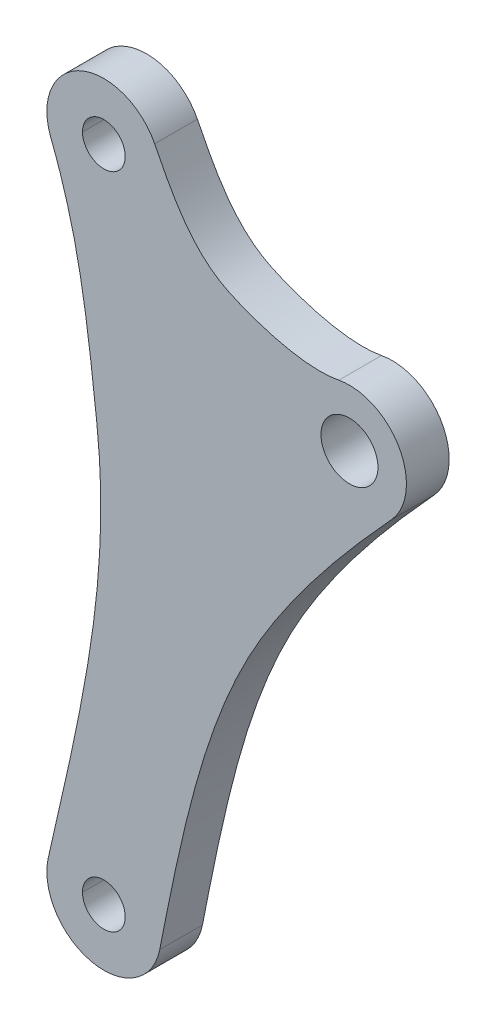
ISO-10303-21;
HEADER;
FILE_DESCRIPTION(('STEP AP214'),'2;1');
FILE_NAME('part.step','',(''),(''),'','','');
FILE_SCHEMA(('AUTOMOTIVE_DESIGN { 1 0 10303 214 1 1 1 1 }'));
ENDSEC;
DATA;
#1=APPLICATION_CONTEXT('core data for automotive mechanical design processes');
#2=APPLICATION_PROTOCOL_DEFINITION('international standard','automotive_design',2000,#1);
#3=PRODUCT_CONTEXT('',#1,'mechanical');
#4=PRODUCT('Part','Part','',(#3));
#5=PRODUCT_RELATED_PRODUCT_CATEGORY('part','',(#4));
#6=PRODUCT_DEFINITION_FORMATION('','',#4);
#7=PRODUCT_DEFINITION_CONTEXT('part definition',#1,'design');
#8=PRODUCT_DEFINITION('design','',#6,#7);
#9=PRODUCT_DEFINITION_SHAPE('','',#8);
#10=(LENGTH_UNIT() NAMED_UNIT(*) SI_UNIT(.MILLI.,.METRE.));
#11=(NAMED_UNIT(*) PLANE_ANGLE_UNIT() SI_UNIT($,.RADIAN.));
#12=(NAMED_UNIT(*) SI_UNIT($,.STERADIAN.) SOLID_ANGLE_UNIT());
#13=UNCERTAINTY_MEASURE_WITH_UNIT(LENGTH_MEASURE(1.E-05),#10,'distance_accuracy_value','');
#14=(GEOMETRIC_REPRESENTATION_CONTEXT(3) GLOBAL_UNCERTAINTY_ASSIGNED_CONTEXT((#13)) GLOBAL_UNIT_ASSIGNED_CONTEXT((#10,
#11,#12)) REPRESENTATION_CONTEXT('',''));
#15=CARTESIAN_POINT('',(0.,0.,0.));
#16=DIRECTION('',(0.,0.,1.));
#17=DIRECTION('',(1.,0.,0.));
#18=AXIS2_PLACEMENT_3D('',#15,#16,#17);
#19=CARTESIAN_POINT('',(81.0474776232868,29.1741521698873,3.));
#20=DIRECTION('',(0.,0.,-1.));
#21=DIRECTION('',(-1.,0.,0.));
#22=AXIS2_PLACEMENT_3D('',#19,#20,#21);
#23=CYLINDRICAL_SURFACE('',#22,4.);
#24=DIRECTION('',(0.,0.,-1.));
#25=VECTOR('',#24,1.);
#26=CARTESIAN_POINT('',(77.145713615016,30.0551956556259,1.5));
#27=LINE('',#26,#25);
#28=CARTESIAN_POINT('',(77.145713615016,30.0551956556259,3.));
#29=VERTEX_POINT('',#28);
#30=CARTESIAN_POINT('',(77.145713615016,30.0551956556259,0.));
#31=VERTEX_POINT('',#30);
#32=EDGE_CURVE('E125',#29,#31,#27,.T.);
#33=ORIENTED_EDGE('',*,*,#32,.T.);
#34=CARTESIAN_POINT('',(81.0474776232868,29.1741521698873,0.));
#35=DIRECTION('',(0.,0.,-1.));
#36=DIRECTION('',(-1.,0.,0.));
#37=AXIS2_PLACEMENT_3D('',#34,#35,#36);
#38=CIRCLE('',#37,4.);
#39=CARTESIAN_POINT('',(77.0474776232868,29.1741521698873,0.));
#40=VERTEX_POINT('',#39);
#41=EDGE_CURVE('E299',#40,#31,#38,.T.);
#42=ORIENTED_EDGE('',*,*,#41,.F.);
#43=DIRECTION('',(0.,0.,-1.));
#44=VECTOR('',#43,1.);
#45=CARTESIAN_POINT('',(77.0474776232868,29.1741521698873,3.));
#46=LINE('',#45,#44);
#47=CARTESIAN_POINT('',(77.0474776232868,29.1741521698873,3.));
#48=VERTEX_POINT('',#47);
#49=EDGE_CURVE('E126',#48,#40,#46,.T.);
#50=ORIENTED_EDGE('',*,*,#49,.F.);
#51=CARTESIAN_POINT('',(81.0474776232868,29.1741521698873,3.));
#52=DIRECTION('',(0.,0.,-1.));
#53=DIRECTION('',(-1.,0.,0.));
#54=AXIS2_PLACEMENT_3D('',#51,#52,#53);
#55=CIRCLE('',#54,4.);
#56=EDGE_CURVE('E37',#48,#29,#55,.T.);
#57=ORIENTED_EDGE('',*,*,#56,.T.);
#58=EDGE_LOOP('',(#33,#42,#50,#57));
#59=FACE_BOUND('',#58,.T.);
#60=ADVANCED_FACE('F30',(#59),#23,.T.);
#61=CARTESIAN_POINT('',(81.0474776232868,75.4068420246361,3.));
#62=DIRECTION('',(0.,0.,-1.));
#63=DIRECTION('',(-1.,0.,0.));
#64=AXIS2_PLACEMENT_3D('',#61,#62,#63);
#65=CYLINDRICAL_SURFACE('',#64,4.);
#66=CARTESIAN_POINT('',(81.0474776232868,75.4068420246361,0.));
#67=DIRECTION('',(0.,0.,-1.));
#68=DIRECTION('',(-1.,0.,0.));
#69=AXIS2_PLACEMENT_3D('',#66,#67,#68);
#70=CIRCLE('',#69,4.);
#71=CARTESIAN_POINT('',(77.3244716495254,73.9442325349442,0.));
#72=VERTEX_POINT('',#71);
#73=CARTESIAN_POINT('',(77.0474776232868,75.4068420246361,0.));
#74=VERTEX_POINT('',#73);
#75=EDGE_CURVE('E274',#72,#74,#70,.T.);
#76=ORIENTED_EDGE('',*,*,#75,.F.);
#77=DIRECTION('',(0.,0.,1.));
#78=VECTOR('',#77,1.);
#79=CARTESIAN_POINT('',(77.3244716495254,73.9442325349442,1.5));
#80=LINE('',#79,#78);
#81=CARTESIAN_POINT('',(77.3244716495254,73.9442325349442,3.));
#82=VERTEX_POINT('',#81);
#83=EDGE_CURVE('E137',#72,#82,#80,.T.);
#84=ORIENTED_EDGE('',*,*,#83,.T.);
#85=CARTESIAN_POINT('',(81.0474776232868,75.4068420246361,3.));
#86=DIRECTION('',(0.,0.,-1.));
#87=DIRECTION('',(-1.,0.,0.));
#88=AXIS2_PLACEMENT_3D('',#85,#86,#87);
#89=CIRCLE('',#88,4.);
#90=CARTESIAN_POINT('',(77.0474776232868,75.4068420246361,3.));
#91=VERTEX_POINT('',#90);
#92=EDGE_CURVE('E128',#82,#91,#89,.T.);
#93=ORIENTED_EDGE('',*,*,#92,.T.);
#94=DIRECTION('',(0.,0.,-1.));
#95=VECTOR('',#94,1.);
#96=CARTESIAN_POINT('',(77.0474776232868,75.4068420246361,3.));
#97=LINE('',#96,#95);
#98=EDGE_CURVE('E269',#74,#91,#97,.F.);
#99=ORIENTED_EDGE('',*,*,#98,.F.);
#100=EDGE_LOOP('',(#76,#84,#93,#99));
#101=FACE_BOUND('',#100,.T.);
#102=ADVANCED_FACE('F222',(#101),#65,.T.);
#103=CARTESIAN_POINT('',(90.075671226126,46.9690028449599,0.));
#104=DIRECTION('',(0.,0.,-1.));
#105=DIRECTION('',(-1.,0.,0.));
#106=AXIS2_PLACEMENT_3D('',#103,#104,#105);
#107=PLANE('',#106);
#108=CARTESIAN_POINT('',(98.2930047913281,65.3775283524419,0.));
#109=DIRECTION('',(0.,0.,1.));
#110=DIRECTION('',(1.,0.,0.));
#111=AXIS2_PLACEMENT_3D('',#108,#109,#110);
#112=CIRCLE('',#111,2.);
#113=CARTESIAN_POINT('',(100.293004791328,65.3775283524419,0.));
#114=VERTEX_POINT('',#113);
#115=EDGE_CURVE('E129',#114,#114,#112,.T.);
#116=ORIENTED_EDGE('',*,*,#115,.T.);
#117=EDGE_LOOP('',(#116));
#118=FACE_BOUND('',#117,.T.);
#119=CARTESIAN_POINT('',(81.0474776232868,29.1741521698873,0.));
#120=DIRECTION('',(0.,0.,-1.));
#121=DIRECTION('',(-1.,0.,0.));
#122=AXIS2_PLACEMENT_3D('',#119,#120,#121);
#123=CIRCLE('',#122,1.5);
#124=CARTESIAN_POINT('',(79.5474776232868,29.1741521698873,0.));
#125=VERTEX_POINT('',#124);
#126=CARTESIAN_POINT('',(82.5474776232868,29.1741521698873,0.));
#127=VERTEX_POINT('',#126);
#128=EDGE_CURVE('E246',#125,#127,#123,.F.);
#129=ORIENTED_EDGE('',*,*,#128,.T.);
#130=CARTESIAN_POINT('',(81.0474776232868,29.1741521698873,0.));
#131=DIRECTION('',(0.,0.,-1.));
#132=DIRECTION('',(-1.,0.,0.));
#133=AXIS2_PLACEMENT_3D('',#130,#131,#132);
#134=CIRCLE('',#133,1.5);
#135=EDGE_CURVE('E245',#127,#125,#134,.F.);
#136=ORIENTED_EDGE('',*,*,#135,.T.);
#137=EDGE_LOOP('',(#129,#136));
#138=FACE_BOUND('',#137,.T.);
#139=CARTESIAN_POINT('',(81.0474776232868,75.4068420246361,0.));
#140=DIRECTION('',(0.,0.,-1.));
#141=DIRECTION('',(-1.,0.,0.));
#142=AXIS2_PLACEMENT_3D('',#139,#140,#141);
#143=CIRCLE('',#142,1.5);
#144=CARTESIAN_POINT('',(79.5474776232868,75.4068420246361,0.));
#145=VERTEX_POINT('',#144);
#146=CARTESIAN_POINT('',(82.5474776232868,75.4068420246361,0.));
#147=VERTEX_POINT('',#146);
#148=EDGE_CURVE('E241',#145,#147,#143,.F.);
#149=ORIENTED_EDGE('',*,*,#148,.T.);
#150=CARTESIAN_POINT('',(81.0474776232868,75.4068420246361,0.));
#151=DIRECTION('',(0.,0.,-1.));
#152=DIRECTION('',(-1.,0.,0.));
#153=AXIS2_PLACEMENT_3D('',#150,#151,#152);
#154=CIRCLE('',#153,1.5);
#155=EDGE_CURVE('E237',#147,#145,#154,.F.);
#156=ORIENTED_EDGE('',*,*,#155,.T.);
#157=EDGE_LOOP('',(#149,#156));
#158=FACE_BOUND('',#157,.T.);
#159=CARTESIAN_POINT('',(84.6155667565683,77.2148077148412,0.));
#160=CARTESIAN_POINT('',(84.6916915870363,77.0645560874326,0.));
#161=CARTESIAN_POINT('',(84.7677576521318,76.9142716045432,0.));
#162=CARTESIAN_POINT('',(84.9211593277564,76.6126359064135,0.));
#163=CARTESIAN_POINT('',(84.9985001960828,76.4612873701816,0.));
#164=CARTESIAN_POINT('',(85.1549995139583,76.1582612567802,0.));
#165=CARTESIAN_POINT('',(85.2341665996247,76.0065881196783,0.));
#166=CARTESIAN_POINT('',(85.3948587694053,75.7036492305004,0.));
#167=CARTESIAN_POINT('',(85.4763925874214,75.5523880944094,0.));
#168=CARTESIAN_POINT('',(85.6423667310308,75.2510130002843,0.));
#169=CARTESIAN_POINT('',(85.7268132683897,75.1009024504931,0.));
#170=CARTESIAN_POINT('',(85.8991679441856,74.8025714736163,0.));
#171=CARTESIAN_POINT('',(85.9870778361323,74.6543520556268,0.));
#172=CARTESIAN_POINT('',(86.1640529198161,74.3652413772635,0.));
#173=CARTESIAN_POINT('',(86.2529855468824,74.224269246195,0.));
#174=CARTESIAN_POINT('',(86.435151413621,73.9454726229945,0.));
#175=CARTESIAN_POINT('',(86.5283768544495,73.8076430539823,0.));
#176=CARTESIAN_POINT('',(86.7196648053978,73.5358203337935,0.));
#177=CARTESIAN_POINT('',(86.8177162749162,73.4018194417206,0.));
#178=CARTESIAN_POINT('',(87.019206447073,73.1383528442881,0.));
#179=CARTESIAN_POINT('',(87.1226335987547,73.0088783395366,0.));
#180=CARTESIAN_POINT('',(87.3354385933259,72.7551765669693,0.));
#181=CARTESIAN_POINT('',(87.4448087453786,72.6309428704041,0.));
#182=CARTESIAN_POINT('',(87.6700871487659,72.3884426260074,0.));
#183=CARTESIAN_POINT('',(87.7859976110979,72.2701781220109,0.));
#184=CARTESIAN_POINT('',(88.0016890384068,72.0627317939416,0.));
#185=CARTESIAN_POINT('',(88.1002932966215,71.9723261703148,0.));
#186=CARTESIAN_POINT('',(88.3020590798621,71.7966208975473,0.));
#187=CARTESIAN_POINT('',(88.4052230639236,71.7113240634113,0.));
#188=CARTESIAN_POINT('',(88.6159711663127,71.5465057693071,0.));
#189=CARTESIAN_POINT('',(88.7235526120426,71.4669808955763,0.));
#190=CARTESIAN_POINT('',(88.9429316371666,71.3142609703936,0.));
#191=CARTESIAN_POINT('',(89.0547236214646,71.2410579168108,0.));
#192=CARTESIAN_POINT('',(89.2256457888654,71.1362219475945,0.));
#193=CARTESIAN_POINT('',(89.2832387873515,71.1020620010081,0.));
#194=CARTESIAN_POINT('',(89.3993813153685,71.0354074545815,0.));
#195=CARTESIAN_POINT('',(89.4579308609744,71.0029128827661,0.));
#196=CARTESIAN_POINT('',(89.634859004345,70.9076505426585,0.));
#197=CARTESIAN_POINT('',(89.7544559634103,70.8471412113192,0.));
#198=CARTESIAN_POINT('',(89.9961430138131,70.7309904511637,0.));
#199=CARTESIAN_POINT('',(90.1182359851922,70.6753550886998,0.));
#200=CARTESIAN_POINT('',(90.36417688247,70.5679245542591,0.));
#201=CARTESIAN_POINT('',(90.4880258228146,70.5161317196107,0.));
#202=CARTESIAN_POINT('',(90.6942065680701,70.432656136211,0.));
#203=CARTESIAN_POINT('',(90.7762151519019,70.4001664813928,0.));
#204=CARTESIAN_POINT('',(90.9406019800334,70.336133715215,0.));
#205=CARTESIAN_POINT('',(91.0229802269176,70.3045906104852,0.));
#206=CARTESIAN_POINT('',(91.1880365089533,70.2425131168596,0.));
#207=CARTESIAN_POINT('',(91.2707142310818,70.2119778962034,0.));
#208=CARTESIAN_POINT('',(91.4364334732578,70.1519146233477,0.));
#209=CARTESIAN_POINT('',(91.5194749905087,70.1223865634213,0.));
#210=CARTESIAN_POINT('',(91.7690685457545,70.0353854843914,0.));
#211=CARTESIAN_POINT('',(91.9361661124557,69.9794667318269,0.));
#212=CARTESIAN_POINT('',(92.2717891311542,69.8720649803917,0.));
#213=CARTESIAN_POINT('',(92.4403146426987,69.8205821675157,0.));
#214=CARTESIAN_POINT('',(92.7785680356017,69.7224625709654,0.));
#215=CARTESIAN_POINT('',(92.9482943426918,69.6758203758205,0.));
#216=CARTESIAN_POINT('',(93.2891243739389,69.5877349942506,0.));
#217=CARTESIAN_POINT('',(93.460228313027,69.5462926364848,0.));
#218=CARTESIAN_POINT('',(93.8037340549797,69.4691331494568,0.));
#219=CARTESIAN_POINT('',(93.9761359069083,69.4334162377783,0.));
#220=CARTESIAN_POINT('',(94.3221883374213,69.3683329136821,0.));
#221=CARTESIAN_POINT('',(94.4958391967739,69.3389679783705,0.));
#222=CARTESIAN_POINT('',(94.7891131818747,69.2955385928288,0.));
#223=CARTESIAN_POINT('',(94.9084560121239,69.2795722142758,0.));
#224=CARTESIAN_POINT('',(95.147556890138,69.2512787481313,0.));
#225=CARTESIAN_POINT('',(95.2673148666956,69.238951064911,0.));
#226=CARTESIAN_POINT('',(95.5071056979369,69.2182783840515,0.));
#227=CARTESIAN_POINT('',(95.6271383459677,69.2099310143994,0.));
#228=CARTESIAN_POINT('',(95.8673441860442,69.1976060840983,0.));
#229=CARTESIAN_POINT('',(95.9875172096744,69.1936253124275,0.));
#230=CARTESIAN_POINT('',(96.2279725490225,69.1904747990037,0.));
#231=CARTESIAN_POINT('',(96.348254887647,69.1913066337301,0.));
#232=CARTESIAN_POINT('',(96.5887064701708,69.1983090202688,0.));
#233=CARTESIAN_POINT('',(96.7088756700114,69.204481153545,0.));
#234=CARTESIAN_POINT('',(96.9489637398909,69.2227735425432,0.));
#235=CARTESIAN_POINT('',(97.0688819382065,69.2349029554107,0.));
#236=CARTESIAN_POINT('',(97.308286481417,69.2658634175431,0.));
#237=CARTESIAN_POINT('',(97.4277696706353,69.2847186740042,0.));
#238=CARTESIAN_POINT('',(97.5465993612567,69.3072712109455,0.));
#239=B_SPLINE_CURVE_WITH_KNOTS('',3,(#159,#160,#161,#162,#163,#164,#165,#166,#167,#168,#169,
#170,#171,#172,#173,#174,#175,#176,#177,#178,#179,#180,#181,#182,#183,#184,#185,#186,#187,#188,
#189,#190,#191,#192,#193,#194,#195,#196,#197,#198,#199,#200,#201,#202,#203,#204,#205,#206,#207,
#208,#209,#210,#211,#212,#213,#214,#215,#216,#217,#218,#219,#220,#221,#222,#223,#224,#225,#226,
#227,#228,#229,#230,#231,#232,#233,#234,#235,#236,#237,#238),.UNSPECIFIED.,.F.,.F.,(4,2,2,2,2,2,
2,2,2,2,2,2,2,2,2,2,2,2,2,2,2,2,2,2,2,2,2,2,2,2,2,2,2,2,2,2,2,2,2,4),(0.,0.505311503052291,
1.01520348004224,1.52846654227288,2.04395450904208,2.56061957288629,3.07754967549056,
3.57751746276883,4.07661026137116,4.57461001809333,5.07158069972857,5.56792289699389,
6.06443390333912,6.46560347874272,6.86699210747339,7.26814137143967,7.668775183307,
7.8696349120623,8.0704980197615,8.47243845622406,8.87487226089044,9.2775488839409,
9.54217331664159,9.80679960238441,10.0712017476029,10.3356018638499,10.8641568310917,
11.3927339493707,11.9207136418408,12.4487773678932,12.976861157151,13.5050676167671,
13.8662378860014,14.2273490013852,14.5882446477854,14.9488747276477,15.3096229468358,
15.6704780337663,16.0318895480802,16.3946151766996),.UNSPECIFIED.);
#240=CARTESIAN_POINT('',(84.6155667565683,77.2148077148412,0.));
#241=VERTEX_POINT('',#240);
#242=CARTESIAN_POINT('',(97.5465993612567,69.3072712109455,0.));
#243=VERTEX_POINT('',#242);
#244=EDGE_CURVE('E203',#241,#243,#239,.T.);
#245=ORIENTED_EDGE('',*,*,#244,.T.);
#246=CARTESIAN_POINT('',(98.2930047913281,65.3775283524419,0.));
#247=DIRECTION('',(0.,0.,-1.));
#248=DIRECTION('',(-1.,0.,0.));
#249=AXIS2_PLACEMENT_3D('',#246,#247,#248);
#250=CIRCLE('',#249,4.);
#251=CARTESIAN_POINT('',(101.238857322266,62.6716176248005,0.));
#252=VERTEX_POINT('',#251);
#253=EDGE_CURVE('E211',#252,#243,#250,.F.);
#254=ORIENTED_EDGE('',*,*,#253,.F.);
#255=CARTESIAN_POINT('',(101.238857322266,62.6716176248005,0.));
#256=CARTESIAN_POINT('',(101.069756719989,62.4875216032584,0.));
#257=CARTESIAN_POINT('',(100.901121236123,62.3029974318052,0.));
#258=CARTESIAN_POINT('',(100.564933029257,61.9330921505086,0.));
#259=CARTESIAN_POINT('',(100.397379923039,61.7477113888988,0.));
#260=CARTESIAN_POINT('',(100.063425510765,61.3760027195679,0.));
#261=CARTESIAN_POINT('',(99.8970239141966,61.1896750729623,0.));
#262=CARTESIAN_POINT('',(99.5654448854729,60.8159801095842,0.));
#263=CARTESIAN_POINT('',(99.4002672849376,60.6286129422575,0.));
#264=CARTESIAN_POINT('',(99.0708807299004,60.2523668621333,0.));
#265=CARTESIAN_POINT('',(98.9066743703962,60.0634856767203,0.));
#266=CARTESIAN_POINT('',(98.5796450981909,59.6844877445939,0.));
#267=CARTESIAN_POINT('',(98.4168223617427,59.4943708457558,0.));
#268=CARTESIAN_POINT('',(98.0926424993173,59.1128022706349,0.));
#269=CARTESIAN_POINT('',(97.9312857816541,58.9213502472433,0.));
#270=CARTESIAN_POINT('',(97.6101244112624,58.5370104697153,0.));
#271=CARTESIAN_POINT('',(97.4503204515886,58.3441221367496,0.));
#272=CARTESIAN_POINT('',(96.9855066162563,57.7779311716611,0.));
#273=CARTESIAN_POINT('',(96.6828395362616,57.4026986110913,0.));
#274=CARTESIAN_POINT('',(96.0846754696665,56.6463226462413,0.));
#275=CARTESIAN_POINT('',(95.789181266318,56.2651770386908,0.));
#276=CARTESIAN_POINT('',(95.2064262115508,55.4966808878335,0.));
#277=CARTESIAN_POINT('',(94.9191647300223,55.1093308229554,0.));
#278=CARTESIAN_POINT('',(94.3539533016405,54.3281136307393,0.));
#279=CARTESIAN_POINT('',(94.0759996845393,53.9342491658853,0.));
#280=CARTESIAN_POINT('',(93.6668141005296,53.3383054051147,0.));
#281=CARTESIAN_POINT('',(93.5317451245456,53.1388541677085,0.));
#282=CARTESIAN_POINT('',(93.2643323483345,52.7381337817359,0.));
#283=CARTESIAN_POINT('',(93.1319885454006,52.5368646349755,0.));
#284=CARTESIAN_POINT('',(92.7395857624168,51.9303123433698,0.));
#285=CARTESIAN_POINT('',(92.4840264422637,51.5220974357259,0.));
#286=CARTESIAN_POINT('',(91.9868915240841,50.6963452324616,0.));
#287=CARTESIAN_POINT('',(91.7453381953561,50.2787944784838,0.));
#288=CARTESIAN_POINT('',(91.2790742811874,49.4343088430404,0.));
#289=CARTESIAN_POINT('',(91.054365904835,49.0073727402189,0.));
#290=CARTESIAN_POINT('',(90.6212412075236,48.1451837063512,0.));
#291=CARTESIAN_POINT('',(90.412829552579,47.7099284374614,0.));
#292=CARTESIAN_POINT('',(90.0116275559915,46.8321253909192,0.));
#293=CARTESIAN_POINT('',(89.8188421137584,46.3895753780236,0.));
#294=CARTESIAN_POINT('',(89.4480534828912,45.4982966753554,0.));
#295=CARTESIAN_POINT('',(89.2700515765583,45.049567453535,0.));
#296=CARTESIAN_POINT('',(88.9278721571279,44.1470919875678,0.));
#297=CARTESIAN_POINT('',(88.7636890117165,43.6933478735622,0.));
#298=CARTESIAN_POINT('',(88.4668681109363,42.8362709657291,0.));
#299=CARTESIAN_POINT('',(88.3328098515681,42.4334279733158,0.));
#300=CARTESIAN_POINT('',(88.073635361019,41.6250208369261,0.));
#301=CARTESIAN_POINT('',(87.9485163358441,41.2194575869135,0.));
#302=CARTESIAN_POINT('',(87.70630914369,40.4059441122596,0.));
#303=CARTESIAN_POINT('',(87.5892210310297,39.9979938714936,0.));
#304=CARTESIAN_POINT('',(87.3621782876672,39.1800337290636,0.));
#305=CARTESIAN_POINT('',(87.2522250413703,38.7700234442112,0.));
#306=CARTESIAN_POINT('',(87.0385735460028,37.9482658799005,0.));
#307=CARTESIAN_POINT('',(86.9348769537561,37.5365181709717,0.));
#308=CARTESIAN_POINT('',(86.7328822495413,36.71160209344,0.));
#309=CARTESIAN_POINT('',(86.6345854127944,36.298433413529,0.));
#310=CARTESIAN_POINT('',(86.442393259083,35.4702714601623,0.));
#311=CARTESIAN_POINT('',(86.3485064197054,35.0552762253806,0.));
#312=CARTESIAN_POINT('',(86.1645092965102,34.2244802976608,0.));
#313=CARTESIAN_POINT('',(86.0743987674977,33.8086796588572,0.));
#314=CARTESIAN_POINT('',(85.8971796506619,32.9765816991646,0.));
#315=CARTESIAN_POINT('',(85.8100701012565,32.5602845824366,0.));
#316=CARTESIAN_POINT('',(85.6381116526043,31.7274955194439,0.));
#317=CARTESIAN_POINT('',(85.5532613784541,31.3110038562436,0.));
#318=CARTESIAN_POINT('',(85.3851124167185,30.4781211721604,0.));
#319=CARTESIAN_POINT('',(85.3018123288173,30.0617304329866,0.));
#320=CARTESIAN_POINT('',(85.1360997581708,29.229334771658,0.));
#321=CARTESIAN_POINT('',(85.0536862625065,28.8133300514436,0.));
#322=CARTESIAN_POINT('',(84.9713185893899,28.397317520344,0.));
#323=B_SPLINE_CURVE_WITH_KNOTS('',3,(#255,#256,#257,#258,#259,#260,#261,#262,#263,#264,#265,
#266,#267,#268,#269,#270,#271,#272,#273,#274,#275,#276,#277,#278,#279,#280,#281,#282,#283,#284,
#285,#286,#287,#288,#289,#290,#291,#292,#293,#294,#295,#296,#297,#298,#299,#300,#301,#302,#303,
#304,#305,#306,#307,#308,#309,#310,#311,#312,#313,#314,#315,#316,#317,#318,#319,#320,#321,#322),
.UNSPECIFIED.,.F.,.F.,(4,2,2,2,2,2,2,2,2,2,2,2,2,2,2,2,2,2,2,2,2,2,2,2,2,2,2,2,2,2,2,2,2,4),(0.,
0.749918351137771,1.49955478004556,2.2489946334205,2.99832940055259,3.74916145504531,
4.50008776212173,5.25121717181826,6.00266771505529,7.44884018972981,8.89556512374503,
10.3421790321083,11.788215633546,12.5108439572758,13.2334715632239,14.6780457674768,
16.1248571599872,17.5718579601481,19.0192715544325,20.4671372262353,21.9151283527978,
23.36252641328,24.6361070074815,25.9092877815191,27.1824771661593,28.4559128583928,
29.7296843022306,31.0037552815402,32.2801828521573,33.5565274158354,34.8324591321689,
36.1075957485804,37.3815183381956,38.6537851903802),.UNSPECIFIED.);
#324=CARTESIAN_POINT('',(84.9713185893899,28.397317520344,0.));
#325=VERTEX_POINT('',#324);
#326=EDGE_CURVE('E231',#252,#325,#323,.T.);
#327=ORIENTED_EDGE('',*,*,#326,.T.);
#328=CARTESIAN_POINT('',(81.0474776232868,29.1741521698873,0.));
#329=DIRECTION('',(0.,0.,-1.));
#330=DIRECTION('',(-1.,0.,0.));
#331=AXIS2_PLACEMENT_3D('',#328,#329,#330);
#332=CIRCLE('',#331,4.);
#333=EDGE_CURVE('E272',#40,#325,#332,.F.);
#334=ORIENTED_EDGE('',*,*,#333,.F.);
#335=ORIENTED_EDGE('',*,*,#41,.T.);
#336=CARTESIAN_POINT('',(77.145713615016,30.0551956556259,0.));
#337=CARTESIAN_POINT('',(77.2190664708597,30.3800420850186,0.));
#338=CARTESIAN_POINT('',(77.292754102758,30.7048124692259,0.));
#339=CARTESIAN_POINT('',(77.4404934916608,31.3542740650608,0.));
#340=CARTESIAN_POINT('',(77.5145452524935,31.678965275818,0.));
#341=CARTESIAN_POINT('',(77.662706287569,32.3283362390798,0.));
#342=CARTESIAN_POINT('',(77.7368155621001,32.6530159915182,0.));
#343=CARTESIAN_POINT('',(77.8849229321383,33.3030275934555,0.));
#344=CARTESIAN_POINT('',(77.958920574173,33.6283595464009,0.));
#345=CARTESIAN_POINT('',(78.1063623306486,34.2791475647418,0.));
#346=CARTESIAN_POINT('',(78.1798064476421,34.6046036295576,0.));
#347=CARTESIAN_POINT('',(78.3258351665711,35.2557072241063,0.));
#348=CARTESIAN_POINT('',(78.3984197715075,35.5813547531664,0.));
#349=CARTESIAN_POINT('',(78.6145934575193,36.5594489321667,0.));
#350=CARTESIAN_POINT('',(78.756428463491,37.2122860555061,0.));
#351=CARTESIAN_POINT('',(79.0329288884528,38.5194953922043,0.));
#352=CARTESIAN_POINT('',(79.1675942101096,39.1738676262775,0.));
#353=CARTESIAN_POINT('',(79.4272070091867,40.484638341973,0.));
#354=CARTESIAN_POINT('',(79.5521532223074,41.1410370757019,0.));
#355=CARTESIAN_POINT('',(79.7895151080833,42.4553037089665,0.));
#356=CARTESIAN_POINT('',(79.901945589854,43.1131689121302,0.));
#357=CARTESIAN_POINT('',(80.1116984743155,44.4312853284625,0.));
#358=CARTESIAN_POINT('',(80.209021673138,45.0915364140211,0.));
#359=CARTESIAN_POINT('',(80.3857091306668,46.4143817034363,0.));
#360=CARTESIAN_POINT('',(80.4650759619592,47.076975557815,0.));
#361=CARTESIAN_POINT('',(80.5689827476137,48.0774882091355,0.));
#362=CARTESIAN_POINT('',(80.6012752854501,48.4146109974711,0.));
#363=CARTESIAN_POINT('',(80.6600912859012,49.0893708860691,0.));
#364=CARTESIAN_POINT('',(80.6866146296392,49.4270079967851,0.));
#365=CARTESIAN_POINT('',(80.7334995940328,50.1027199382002,0.));
#366=CARTESIAN_POINT('',(80.7538610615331,50.4407947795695,0.));
#367=CARTESIAN_POINT('',(80.7880321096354,51.1173295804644,0.));
#368=CARTESIAN_POINT('',(80.8018406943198,51.4557895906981,0.));
#369=CARTESIAN_POINT('',(80.8225120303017,52.1329210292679,0.));
#370=CARTESIAN_POINT('',(80.8293748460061,52.4715924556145,0.));
#371=CARTESIAN_POINT('',(80.8357726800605,53.148998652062,0.));
#372=CARTESIAN_POINT('',(80.8353078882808,53.4877334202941,0.));
#373=CARTESIAN_POINT('',(80.8266735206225,54.1653391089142,0.));
#374=CARTESIAN_POINT('',(80.8184986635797,54.50420996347,0.));
#375=CARTESIAN_POINT('',(80.7940861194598,55.1816652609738,0.));
#376=CARTESIAN_POINT('',(80.7778484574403,55.5202497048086,0.));
#377=CARTESIAN_POINT('',(80.73694277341,56.196886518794,0.));
#378=CARTESIAN_POINT('',(80.7122751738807,56.5349389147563,0.));
#379=CARTESIAN_POINT('',(80.6562590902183,57.2104406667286,0.));
#380=CARTESIAN_POINT('',(80.6249112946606,57.5478900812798,0.));
#381=CARTESIAN_POINT('',(80.557254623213,58.222302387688,0.));
#382=CARTESIAN_POINT('',(80.5209454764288,58.5592652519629,0.));
#383=CARTESIAN_POINT('',(80.4640318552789,59.064438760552,0.));
#384=CARTESIAN_POINT('',(80.444651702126,59.2327899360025,0.));
#385=CARTESIAN_POINT('',(80.4052861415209,59.5694217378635,0.));
#386=CARTESIAN_POINT('',(80.3853007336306,59.737702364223,0.));
#387=CARTESIAN_POINT('',(80.344942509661,60.0743127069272,0.));
#388=CARTESIAN_POINT('',(80.324569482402,60.2426423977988,0.));
#389=CARTESIAN_POINT('',(80.2836232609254,60.5792773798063,0.));
#390=CARTESIAN_POINT('',(80.2630500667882,60.7475826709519,0.));
#391=CARTESIAN_POINT('',(80.2215732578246,61.0841437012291,0.));
#392=CARTESIAN_POINT('',(80.2006696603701,61.2523994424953,0.));
#393=CARTESIAN_POINT('',(80.1584298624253,61.5888565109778,0.));
#394=CARTESIAN_POINT('',(80.1370936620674,61.7570578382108,0.));
#395=CARTESIAN_POINT('',(80.0722678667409,62.2615629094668,0.));
#396=CARTESIAN_POINT('',(80.0279616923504,62.5977627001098,0.));
#397=CARTESIAN_POINT('',(79.9362754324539,63.269717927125,0.));
#398=CARTESIAN_POINT('',(79.888895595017,63.6054733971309,0.));
#399=CARTESIAN_POINT('',(79.7901477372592,64.2763961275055,0.));
#400=CARTESIAN_POINT('',(79.7387797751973,64.6115633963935,0.));
#401=CARTESIAN_POINT('',(79.631161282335,65.2810981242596,0.));
#402=CARTESIAN_POINT('',(79.5749110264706,65.6154656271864,0.));
#403=CARTESIAN_POINT('',(79.4553127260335,66.2908381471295,0.));
#404=CARTESIAN_POINT('',(79.3918315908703,66.6318197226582,0.));
#405=CARTESIAN_POINT('',(79.2580467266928,67.3122641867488,0.));
#406=CARTESIAN_POINT('',(79.1877465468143,67.6517277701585,0.));
#407=CARTESIAN_POINT('',(79.0395856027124,68.328828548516,0.));
#408=CARTESIAN_POINT('',(78.9617286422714,68.6664665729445,0.));
#409=CARTESIAN_POINT('',(78.7978293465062,69.339632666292,0.));
#410=CARTESIAN_POINT('',(78.7117898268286,69.6751614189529,0.));
#411=CARTESIAN_POINT('',(78.5313966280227,70.3424828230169,0.));
#412=CARTESIAN_POINT('',(78.4370790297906,70.6742852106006,0.));
#413=CARTESIAN_POINT('',(78.2394515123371,71.335384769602,0.));
#414=CARTESIAN_POINT('',(78.1361371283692,71.6646806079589,0.));
#415=CARTESIAN_POINT('',(77.9202427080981,72.3206603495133,0.));
#416=CARTESIAN_POINT('',(77.8076517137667,72.6473406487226,0.));
#417=CARTESIAN_POINT('',(77.5730772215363,73.2980309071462,0.));
#418=CARTESIAN_POINT('',(77.4510758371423,73.6220344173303,0.));
#419=CARTESIAN_POINT('',(77.3244716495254,73.9442325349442,0.));
#420=B_SPLINE_CURVE_WITH_KNOTS('',3,(#336,#337,#338,#339,#340,#341,#342,#343,#344,#345,#346,
#347,#348,#349,#350,#351,#352,#353,#354,#355,#356,#357,#358,#359,#360,#361,#362,#363,#364,#365,
#366,#367,#368,#369,#370,#371,#372,#373,#374,#375,#376,#377,#378,#379,#380,#381,#382,#383,#384,
#385,#386,#387,#388,#389,#390,#391,#392,#393,#394,#395,#396,#397,#398,#399,#400,#401,#402,#403,
#404,#405,#406,#407,#408,#409,#410,#411,#412,#413,#414,#415,#416,#417,#418,#419),.UNSPECIFIED.,
.F.,.F.,(4,2,2,2,2,2,2,2,2,2,2,2,2,2,2,2,2,2,2,2,2,2,2,2,2,2,2,2,2,2,2,2,2,2,2,2,2,2,2,2,2,4),
(0.,0.999075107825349,1.99816074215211,2.99725141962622,3.99817520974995,4.99909438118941,
6.00001005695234,8.00418359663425,10.0083843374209,12.0128453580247,14.0149088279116,
16.016866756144,18.0185376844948,19.0344943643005,20.0504719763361,21.0664748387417,
22.0826320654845,23.0987798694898,24.1149013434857,25.1317193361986,26.1485341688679,
27.1652980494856,28.1819571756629,29.19867183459,29.7070602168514,30.2154489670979,
30.7241231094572,31.2327970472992,31.7414443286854,32.2500914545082,33.2674009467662,
34.2846284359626,35.301841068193,36.3189964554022,37.3594558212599,38.3993765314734,
39.4387764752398,40.4778200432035,41.5125406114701,42.5477776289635,43.5842555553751,
44.6227545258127),.UNSPECIFIED.);
#421=EDGE_CURVE('E136',#31,#72,#420,.T.);
#422=ORIENTED_EDGE('',*,*,#421,.T.);
#423=ORIENTED_EDGE('',*,*,#75,.T.);
#424=CARTESIAN_POINT('',(81.0474776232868,75.4068420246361,0.));
#425=DIRECTION('',(0.,0.,-1.));
#426=DIRECTION('',(-1.,0.,0.));
#427=AXIS2_PLACEMENT_3D('',#424,#425,#426);
#428=CIRCLE('',#427,4.);
#429=EDGE_CURVE('E214',#241,#74,#428,.F.);
#430=ORIENTED_EDGE('',*,*,#429,.F.);
#431=EDGE_LOOP('',(#245,#254,#327,#334,#335,#422,#423,#430));
#432=FACE_BOUND('',#431,.T.);
#433=ADVANCED_FACE('F216',(#118,#138,#158,#432),#107,.T.);
#434=CARTESIAN_POINT('',(81.0474776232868,29.1741521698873,3.));
#435=DIRECTION('',(0.,0.,-1.));
#436=DIRECTION('',(-1.,0.,0.));
#437=AXIS2_PLACEMENT_3D('',#434,#435,#436);
#438=CYLINDRICAL_SURFACE('',#437,4.);
#439=ORIENTED_EDGE('',*,*,#333,.T.);
#440=DIRECTION('',(0.,0.,1.));
#441=VECTOR('',#440,1.);
#442=CARTESIAN_POINT('',(84.9713185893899,28.397317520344,1.5));
#443=LINE('',#442,#441);
#444=CARTESIAN_POINT('',(84.9713185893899,28.397317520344,3.));
#445=VERTEX_POINT('',#444);
#446=EDGE_CURVE('E260',#325,#445,#443,.T.);
#447=ORIENTED_EDGE('',*,*,#446,.T.);
#448=CARTESIAN_POINT('',(81.0474776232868,29.1741521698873,3.));
#449=DIRECTION('',(0.,0.,-1.));
#450=DIRECTION('',(-1.,0.,0.));
#451=AXIS2_PLACEMENT_3D('',#448,#449,#450);
#452=CIRCLE('',#451,4.);
#453=EDGE_CURVE('E144',#445,#48,#452,.T.);
#454=ORIENTED_EDGE('',*,*,#453,.T.);
#455=ORIENTED_EDGE('',*,*,#49,.T.);
#456=EDGE_LOOP('',(#439,#447,#454,#455));
#457=FACE_BOUND('',#456,.T.);
#458=ADVANCED_FACE('F221',(#457),#438,.T.);
#459=CARTESIAN_POINT('',(77.3244716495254,73.9442325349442,3.));
#460=CARTESIAN_POINT('',(77.3244716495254,73.9442325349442,0.));
#461=CARTESIAN_POINT('',(79.1435622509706,69.3138200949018,3.));
#462=CARTESIAN_POINT('',(79.1435622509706,69.3138200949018,0.));
#463=CARTESIAN_POINT('',(79.9310185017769,63.6887264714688,3.));
#464=CARTESIAN_POINT('',(79.9310185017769,63.6887264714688,0.));
#465=CARTESIAN_POINT('',(81.6632709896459,48.786134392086,3.));
#466=CARTESIAN_POINT('',(81.6632709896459,48.786134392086,0.));
#467=CARTESIAN_POINT('',(79.0803085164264,38.6226873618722,3.));
#468=CARTESIAN_POINT('',(79.0803085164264,38.6226873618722,0.));
#469=CARTESIAN_POINT('',(77.145713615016,30.0551956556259,3.));
#470=CARTESIAN_POINT('',(77.145713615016,30.0551956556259,0.));
#471=B_SPLINE_SURFACE_WITH_KNOTS('',3,1,((#459,#460),(#461,#462),(#463,#464),(#465,#466),(#467,
#468),(#469,#470)),.UNSPECIFIED.,.F.,.F.,.F.,(4,1,1,4),(2,2),(0.,0.323426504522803,
0.423426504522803,1.),(0.,1.),.UNSPECIFIED.);
#472=CARTESIAN_POINT('',(77.145713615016,30.0551956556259,3.));
#473=CARTESIAN_POINT('',(77.2190664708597,30.3800420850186,3.));
#474=CARTESIAN_POINT('',(77.292754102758,30.7048124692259,3.));
#475=CARTESIAN_POINT('',(77.4404934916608,31.3542740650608,3.));
#476=CARTESIAN_POINT('',(77.5145452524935,31.678965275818,3.));
#477=CARTESIAN_POINT('',(77.662706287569,32.3283362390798,3.));
#478=CARTESIAN_POINT('',(77.7368155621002,32.6530159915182,3.));
#479=CARTESIAN_POINT('',(77.8849229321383,33.3030275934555,3.));
#480=CARTESIAN_POINT('',(77.958920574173,33.6283595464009,3.));
#481=CARTESIAN_POINT('',(78.1063623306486,34.2791475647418,3.));
#482=CARTESIAN_POINT('',(78.1798064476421,34.6046036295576,3.));
#483=CARTESIAN_POINT('',(78.3258351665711,35.2557072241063,3.));
#484=CARTESIAN_POINT('',(78.3984197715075,35.5813547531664,3.));
#485=CARTESIAN_POINT('',(78.6145934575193,36.5594489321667,3.));
#486=CARTESIAN_POINT('',(78.756428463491,37.2122860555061,3.));
#487=CARTESIAN_POINT('',(79.0329288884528,38.5194953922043,3.));
#488=CARTESIAN_POINT('',(79.1675942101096,39.1738676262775,3.));
#489=CARTESIAN_POINT('',(79.4272070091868,40.484638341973,3.));
#490=CARTESIAN_POINT('',(79.5521532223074,41.1410370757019,3.));
#491=CARTESIAN_POINT('',(79.7895151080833,42.4553037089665,3.));
#492=CARTESIAN_POINT('',(79.901945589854,43.1131689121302,3.));
#493=CARTESIAN_POINT('',(80.1116984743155,44.4312853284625,3.));
#494=CARTESIAN_POINT('',(80.209021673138,45.0915364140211,3.));
#495=CARTESIAN_POINT('',(80.3857091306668,46.4143817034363,3.));
#496=CARTESIAN_POINT('',(80.4650759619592,47.076975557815,3.));
#497=CARTESIAN_POINT('',(80.5689827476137,48.0774882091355,3.));
#498=CARTESIAN_POINT('',(80.6012752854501,48.4146109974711,3.));
#499=CARTESIAN_POINT('',(80.6600912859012,49.0893708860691,3.));
#500=CARTESIAN_POINT('',(80.6866146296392,49.4270079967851,3.));
#501=CARTESIAN_POINT('',(80.7334995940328,50.1027199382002,3.));
#502=CARTESIAN_POINT('',(80.7538610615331,50.4407947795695,3.));
#503=CARTESIAN_POINT('',(80.7880321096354,51.1173295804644,3.));
#504=CARTESIAN_POINT('',(80.8018406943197,51.4557895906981,3.));
#505=CARTESIAN_POINT('',(80.8225120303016,52.132921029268,3.));
#506=CARTESIAN_POINT('',(80.8293748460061,52.4715924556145,3.));
#507=CARTESIAN_POINT('',(80.8357726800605,53.148998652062,3.));
#508=CARTESIAN_POINT('',(80.8353078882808,53.4877334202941,3.));
#509=CARTESIAN_POINT('',(80.8266735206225,54.1653391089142,3.));
#510=CARTESIAN_POINT('',(80.8184986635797,54.50420996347,3.));
#511=CARTESIAN_POINT('',(80.7940861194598,55.1816652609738,3.));
#512=CARTESIAN_POINT('',(80.7778484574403,55.5202497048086,3.));
#513=CARTESIAN_POINT('',(80.73694277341,56.196886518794,3.));
#514=CARTESIAN_POINT('',(80.7122751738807,56.5349389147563,3.));
#515=CARTESIAN_POINT('',(80.6562590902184,57.2104406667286,3.));
#516=CARTESIAN_POINT('',(80.6249112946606,57.5478900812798,3.));
#517=CARTESIAN_POINT('',(80.5572546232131,58.222302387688,3.));
#518=CARTESIAN_POINT('',(80.5209454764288,58.5592652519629,3.));
#519=CARTESIAN_POINT('',(80.4640318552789,59.064438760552,3.));
#520=CARTESIAN_POINT('',(80.4446517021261,59.2327899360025,3.));
#521=CARTESIAN_POINT('',(80.4052861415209,59.5694217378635,3.));
#522=CARTESIAN_POINT('',(80.3853007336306,59.737702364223,3.));
#523=CARTESIAN_POINT('',(80.344942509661,60.0743127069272,3.));
#524=CARTESIAN_POINT('',(80.324569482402,60.2426423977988,3.));
#525=CARTESIAN_POINT('',(80.2836232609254,60.5792773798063,3.));
#526=CARTESIAN_POINT('',(80.2630500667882,60.7475826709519,3.));
#527=CARTESIAN_POINT('',(80.2215732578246,61.0841437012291,3.));
#528=CARTESIAN_POINT('',(80.2006696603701,61.2523994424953,3.));
#529=CARTESIAN_POINT('',(80.1584298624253,61.5888565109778,3.));
#530=CARTESIAN_POINT('',(80.1370936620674,61.7570578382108,3.));
#531=CARTESIAN_POINT('',(80.0722678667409,62.2615629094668,3.));
#532=CARTESIAN_POINT('',(80.0279616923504,62.5977627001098,3.));
#533=CARTESIAN_POINT('',(79.9362754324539,63.269717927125,3.));
#534=CARTESIAN_POINT('',(79.888895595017,63.6054733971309,3.));
#535=CARTESIAN_POINT('',(79.7901477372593,64.2763961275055,3.));
#536=CARTESIAN_POINT('',(79.7387797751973,64.6115633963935,3.));
#537=CARTESIAN_POINT('',(79.631161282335,65.2810981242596,3.));
#538=CARTESIAN_POINT('',(79.5749110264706,65.6154656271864,3.));
#539=CARTESIAN_POINT('',(79.4553127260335,66.2908381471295,3.));
#540=CARTESIAN_POINT('',(79.3918315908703,66.6318197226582,3.));
#541=CARTESIAN_POINT('',(79.2580467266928,67.3122641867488,3.));
#542=CARTESIAN_POINT('',(79.1877465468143,67.6517277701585,3.));
#543=CARTESIAN_POINT('',(79.0395856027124,68.328828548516,3.));
#544=CARTESIAN_POINT('',(78.9617286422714,68.6664665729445,3.));
#545=CARTESIAN_POINT('',(78.7978293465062,69.339632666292,3.));
#546=CARTESIAN_POINT('',(78.7117898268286,69.6751614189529,3.));
#547=CARTESIAN_POINT('',(78.5313966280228,70.3424828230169,3.));
#548=CARTESIAN_POINT('',(78.4370790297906,70.6742852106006,3.));
#549=CARTESIAN_POINT('',(78.2394515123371,71.335384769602,3.));
#550=CARTESIAN_POINT('',(78.1361371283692,71.6646806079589,3.));
#551=CARTESIAN_POINT('',(77.9202427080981,72.3206603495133,3.));
#552=CARTESIAN_POINT('',(77.8076517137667,72.6473406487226,3.));
#553=CARTESIAN_POINT('',(77.5730772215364,73.2980309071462,3.));
#554=CARTESIAN_POINT('',(77.4510758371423,73.6220344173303,3.));
#555=CARTESIAN_POINT('',(77.3244716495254,73.9442325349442,3.));
#556=B_SPLINE_CURVE_WITH_KNOTS('',3,(#472,#473,#474,#475,#476,#477,#478,#479,#480,#481,#482,
#483,#484,#485,#486,#487,#488,#489,#490,#491,#492,#493,#494,#495,#496,#497,#498,#499,#500,#501,
#502,#503,#504,#505,#506,#507,#508,#509,#510,#511,#512,#513,#514,#515,#516,#517,#518,#519,#520,
#521,#522,#523,#524,#525,#526,#527,#528,#529,#530,#531,#532,#533,#534,#535,#536,#537,#538,#539,
#540,#541,#542,#543,#544,#545,#546,#547,#548,#549,#550,#551,#552,#553,#554,#555),.UNSPECIFIED.,
.F.,.F.,(4,2,2,2,2,2,2,2,2,2,2,2,2,2,2,2,2,2,2,2,2,2,2,2,2,2,2,2,2,2,2,2,2,2,2,2,2,2,2,2,2,4),
(0.,0.999075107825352,1.99816074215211,2.99725141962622,3.99817520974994,4.99909438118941,
6.00001005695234,8.00418359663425,10.0083843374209,12.0128453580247,14.0149088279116,
16.016866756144,18.0185376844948,19.0344943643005,20.0504719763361,21.0664748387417,
22.0826320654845,23.0987798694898,24.1149013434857,25.1317193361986,26.1485341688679,
27.1652980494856,28.1819571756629,29.19867183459,29.7070602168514,30.2154489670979,
30.7241231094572,31.2327970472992,31.7414443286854,32.2500914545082,33.2674009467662,
34.2846284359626,35.301841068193,36.3189964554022,37.3594558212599,38.3993765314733,
39.4387764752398,40.4778200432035,41.5125406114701,42.5477776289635,43.5842555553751,
44.6227545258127),.UNSPECIFIED.);
#557=EDGE_CURVE('E134',#29,#82,#556,.T.);
#558=ORIENTED_EDGE('',*,*,#32,.F.);
#559=ORIENTED_EDGE('',*,*,#557,.T.);
#560=ORIENTED_EDGE('',*,*,#83,.F.);
#561=ORIENTED_EDGE('',*,*,#421,.F.);
#562=EDGE_LOOP('',(#558,#559,#560,#561));
#563=FACE_BOUND('',#562,.T.);
#564=ADVANCED_FACE('F133',(#563),#471,.F.);
#565=CARTESIAN_POINT('',(81.0474776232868,75.4068420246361,3.));
#566=DIRECTION('',(0.,0.,-1.));
#567=DIRECTION('',(-1.,0.,0.));
#568=AXIS2_PLACEMENT_3D('',#565,#566,#567);
#569=CYLINDRICAL_SURFACE('',#568,4.);
#570=DIRECTION('',(0.,0.,-1.));
#571=VECTOR('',#570,1.);
#572=CARTESIAN_POINT('',(84.6155667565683,77.2148077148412,1.5));
#573=LINE('',#572,#571);
#574=CARTESIAN_POINT('',(84.6155667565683,77.2148077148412,3.));
#575=VERTEX_POINT('',#574);
#576=EDGE_CURVE('E212',#575,#241,#573,.T.);
#577=ORIENTED_EDGE('',*,*,#576,.T.);
#578=ORIENTED_EDGE('',*,*,#429,.T.);
#579=ORIENTED_EDGE('',*,*,#98,.T.);
#580=CARTESIAN_POINT('',(81.0474776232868,75.4068420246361,3.));
#581=DIRECTION('',(0.,0.,-1.));
#582=DIRECTION('',(-1.,0.,0.));
#583=AXIS2_PLACEMENT_3D('',#580,#581,#582);
#584=CIRCLE('',#583,4.);
#585=EDGE_CURVE('E143',#91,#575,#584,.T.);
#586=ORIENTED_EDGE('',*,*,#585,.T.);
#587=EDGE_LOOP('',(#577,#578,#579,#586));
#588=FACE_BOUND('',#587,.T.);
#589=ADVANCED_FACE('F194',(#588),#569,.T.);
#590=CARTESIAN_POINT('',(97.5465993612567,69.3072712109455,3.));
#591=CARTESIAN_POINT('',(97.5465993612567,69.3072712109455,0.));
#592=CARTESIAN_POINT('',(95.6927273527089,68.9551514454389,3.));
#593=CARTESIAN_POINT('',(95.6927273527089,68.9551514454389,0.));
#594=CARTESIAN_POINT('',(92.7095800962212,69.5389356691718,3.));
#595=CARTESIAN_POINT('',(92.7095800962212,69.5389356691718,0.));
#596=CARTESIAN_POINT('',(87.2845297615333,71.8966759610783,3.));
#597=CARTESIAN_POINT('',(87.2845297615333,71.8966759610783,0.));
#598=CARTESIAN_POINT('',(85.7655546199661,74.9452628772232,3.));
#599=CARTESIAN_POINT('',(85.7655546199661,74.9452628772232,0.));
#600=CARTESIAN_POINT('',(84.6155667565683,77.2148077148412,3.));
#601=CARTESIAN_POINT('',(84.6155667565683,77.2148077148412,0.));
#602=B_SPLINE_SURFACE_WITH_KNOTS('',3,1,((#590,#591),(#592,#593),(#594,#595),(#596,#597),(#598,
#599),(#600,#601)),.UNSPECIFIED.,.F.,.F.,.F.,(4,1,1,4),(2,2),(0.,0.443899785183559,
0.543899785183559,1.),(0.,1.),.UNSPECIFIED.);
#603=CARTESIAN_POINT('',(84.6155667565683,77.2148077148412,3.));
#604=CARTESIAN_POINT('',(84.6916915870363,77.0645560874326,3.));
#605=CARTESIAN_POINT('',(84.7677576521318,76.9142716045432,3.));
#606=CARTESIAN_POINT('',(84.9211593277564,76.6126359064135,3.));
#607=CARTESIAN_POINT('',(84.9985001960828,76.4612873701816,3.));
#608=CARTESIAN_POINT('',(85.1549995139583,76.1582612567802,3.));
#609=CARTESIAN_POINT('',(85.2341665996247,76.0065881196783,3.));
#610=CARTESIAN_POINT('',(85.3948587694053,75.7036492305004,3.));
#611=CARTESIAN_POINT('',(85.4763925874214,75.5523880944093,3.));
#612=CARTESIAN_POINT('',(85.6423667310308,75.2510130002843,3.));
#613=CARTESIAN_POINT('',(85.7268132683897,75.1009024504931,3.));
#614=CARTESIAN_POINT('',(85.8991679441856,74.8025714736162,3.));
#615=CARTESIAN_POINT('',(85.9870778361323,74.6543520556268,3.));
#616=CARTESIAN_POINT('',(86.1640529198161,74.3652413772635,3.));
#617=CARTESIAN_POINT('',(86.2529855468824,74.224269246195,3.));
#618=CARTESIAN_POINT('',(86.4351514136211,73.9454726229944,3.));
#619=CARTESIAN_POINT('',(86.5283768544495,73.8076430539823,3.));
#620=CARTESIAN_POINT('',(86.7196648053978,73.5358203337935,3.));
#621=CARTESIAN_POINT('',(86.8177162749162,73.4018194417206,3.));
#622=CARTESIAN_POINT('',(87.019206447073,73.1383528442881,3.));
#623=CARTESIAN_POINT('',(87.1226335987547,73.0088783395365,3.));
#624=CARTESIAN_POINT('',(87.3354385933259,72.7551765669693,3.));
#625=CARTESIAN_POINT('',(87.4448087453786,72.6309428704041,3.));
#626=CARTESIAN_POINT('',(87.670087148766,72.3884426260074,3.));
#627=CARTESIAN_POINT('',(87.7859976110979,72.2701781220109,3.));
#628=CARTESIAN_POINT('',(88.0016890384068,72.0627317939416,3.));
#629=CARTESIAN_POINT('',(88.1002932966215,71.9723261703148,3.));
#630=CARTESIAN_POINT('',(88.3020590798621,71.7966208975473,3.));
#631=CARTESIAN_POINT('',(88.4052230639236,71.7113240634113,3.));
#632=CARTESIAN_POINT('',(88.6159711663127,71.5465057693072,3.));
#633=CARTESIAN_POINT('',(88.7235526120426,71.4669808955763,3.));
#634=CARTESIAN_POINT('',(88.9429316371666,71.3142609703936,3.));
#635=CARTESIAN_POINT('',(89.0547236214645,71.2410579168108,3.));
#636=CARTESIAN_POINT('',(89.2256457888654,71.1362219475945,3.));
#637=CARTESIAN_POINT('',(89.2832387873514,71.1020620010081,3.));
#638=CARTESIAN_POINT('',(89.3993813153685,71.0354074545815,3.));
#639=CARTESIAN_POINT('',(89.4579308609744,71.0029128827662,3.));
#640=CARTESIAN_POINT('',(89.6348590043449,70.9076505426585,3.));
#641=CARTESIAN_POINT('',(89.7544559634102,70.8471412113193,3.));
#642=CARTESIAN_POINT('',(89.996143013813,70.7309904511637,3.));
#643=CARTESIAN_POINT('',(90.1182359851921,70.6753550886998,3.));
#644=CARTESIAN_POINT('',(90.3641768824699,70.5679245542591,3.));
#645=CARTESIAN_POINT('',(90.4880258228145,70.5161317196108,3.));
#646=CARTESIAN_POINT('',(90.69420656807,70.4326561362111,3.));
#647=CARTESIAN_POINT('',(90.7762151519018,70.4001664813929,3.));
#648=CARTESIAN_POINT('',(90.9406019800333,70.336133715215,3.));
#649=CARTESIAN_POINT('',(91.0229802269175,70.3045906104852,3.));
#650=CARTESIAN_POINT('',(91.1880365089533,70.2425131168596,3.));
#651=CARTESIAN_POINT('',(91.2707142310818,70.2119778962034,3.));
#652=CARTESIAN_POINT('',(91.4364334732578,70.1519146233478,3.));
#653=CARTESIAN_POINT('',(91.5194749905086,70.1223865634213,3.));
#654=CARTESIAN_POINT('',(91.7690685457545,70.0353854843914,3.));
#655=CARTESIAN_POINT('',(91.9361661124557,69.9794667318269,3.));
#656=CARTESIAN_POINT('',(92.2717891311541,69.8720649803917,3.));
#657=CARTESIAN_POINT('',(92.4403146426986,69.8205821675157,3.));
#658=CARTESIAN_POINT('',(92.7785680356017,69.7224625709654,3.));
#659=CARTESIAN_POINT('',(92.9482943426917,69.6758203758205,3.));
#660=CARTESIAN_POINT('',(93.2891243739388,69.5877349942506,3.));
#661=CARTESIAN_POINT('',(93.4602283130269,69.5462926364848,3.));
#662=CARTESIAN_POINT('',(93.8037340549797,69.4691331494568,3.));
#663=CARTESIAN_POINT('',(93.9761359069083,69.4334162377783,3.));
#664=CARTESIAN_POINT('',(94.3221883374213,69.3683329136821,3.));
#665=CARTESIAN_POINT('',(94.4958391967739,69.3389679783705,3.));
#666=CARTESIAN_POINT('',(94.7891131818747,69.2955385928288,3.));
#667=CARTESIAN_POINT('',(94.9084560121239,69.2795722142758,3.));
#668=CARTESIAN_POINT('',(95.147556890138,69.2512787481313,3.));
#669=CARTESIAN_POINT('',(95.2673148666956,69.238951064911,3.));
#670=CARTESIAN_POINT('',(95.5071056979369,69.2182783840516,3.));
#671=CARTESIAN_POINT('',(95.6271383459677,69.2099310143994,3.));
#672=CARTESIAN_POINT('',(95.8673441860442,69.1976060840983,3.));
#673=CARTESIAN_POINT('',(95.9875172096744,69.1936253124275,3.));
#674=CARTESIAN_POINT('',(96.2279725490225,69.1904747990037,3.));
#675=CARTESIAN_POINT('',(96.348254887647,69.1913066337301,3.));
#676=CARTESIAN_POINT('',(96.5887064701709,69.1983090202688,3.));
#677=CARTESIAN_POINT('',(96.7088756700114,69.204481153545,3.));
#678=CARTESIAN_POINT('',(96.9489637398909,69.2227735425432,3.));
#679=CARTESIAN_POINT('',(97.0688819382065,69.2349029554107,3.));
#680=CARTESIAN_POINT('',(97.308286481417,69.2658634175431,3.));
#681=CARTESIAN_POINT('',(97.4277696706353,69.2847186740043,3.));
#682=CARTESIAN_POINT('',(97.5465993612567,69.3072712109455,3.));
#683=B_SPLINE_CURVE_WITH_KNOTS('',3,(#603,#604,#605,#606,#607,#608,#609,#610,#611,#612,#613,
#614,#615,#616,#617,#618,#619,#620,#621,#622,#623,#624,#625,#626,#627,#628,#629,#630,#631,#632,
#633,#634,#635,#636,#637,#638,#639,#640,#641,#642,#643,#644,#645,#646,#647,#648,#649,#650,#651,
#652,#653,#654,#655,#656,#657,#658,#659,#660,#661,#662,#663,#664,#665,#666,#667,#668,#669,#670,
#671,#672,#673,#674,#675,#676,#677,#678,#679,#680,#681,#682),.UNSPECIFIED.,.F.,.F.,(4,2,2,2,2,2,
2,2,2,2,2,2,2,2,2,2,2,2,2,2,2,2,2,2,2,2,2,2,2,2,2,2,2,2,2,2,2,2,2,4),(0.,0.505311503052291,
1.01520348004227,1.5284665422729,2.04395450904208,2.56061957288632,3.07754967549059,
3.57751746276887,4.07661026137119,4.57461001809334,5.07158069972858,5.56792289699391,
6.06443390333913,6.46560347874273,6.86699210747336,7.26814137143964,7.66877518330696,
7.86963491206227,8.07049801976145,8.472438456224,8.87487226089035,9.27754888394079,
9.5421733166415,9.80679960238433,10.0712017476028,10.3356018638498,10.8641568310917,
11.3927339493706,11.9207136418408,12.4487773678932,12.976861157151,13.5050676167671,
13.8662378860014,14.2273490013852,14.5882446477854,14.9488747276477,15.3096229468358,
15.6704780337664,16.0318895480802,16.3946151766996),.UNSPECIFIED.);
#684=CARTESIAN_POINT('',(97.5465993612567,69.3072712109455,3.));
#685=VERTEX_POINT('',#684);
#686=EDGE_CURVE('E147',#575,#685,#683,.T.);
#687=DIRECTION('',(0.,0.,-1.));
#688=VECTOR('',#687,1.);
#689=CARTESIAN_POINT('',(97.5465993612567,69.3072712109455,3.));
#690=LINE('',#689,#688);
#691=EDGE_CURVE('E263',#243,#685,#690,.F.);
#692=ORIENTED_EDGE('',*,*,#576,.F.);
#693=ORIENTED_EDGE('',*,*,#686,.T.);
#694=ORIENTED_EDGE('',*,*,#691,.F.);
#695=ORIENTED_EDGE('',*,*,#244,.F.);
#696=EDGE_LOOP('',(#692,#693,#694,#695));
#697=FACE_BOUND('',#696,.T.);
#698=ADVANCED_FACE('F188',(#697),#602,.F.);
#699=CARTESIAN_POINT('',(98.2930047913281,65.3775283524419,3.));
#700=DIRECTION('',(0.,0.,-1.));
#701=DIRECTION('',(-1.,0.,0.));
#702=AXIS2_PLACEMENT_3D('',#699,#700,#701);
#703=CYLINDRICAL_SURFACE('',#702,4.);
#704=CARTESIAN_POINT('',(98.2930047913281,65.3775283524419,3.));
#705=DIRECTION('',(0.,0.,-1.));
#706=DIRECTION('',(-1.,0.,0.));
#707=AXIS2_PLACEMENT_3D('',#704,#705,#706);
#708=CIRCLE('',#707,4.);
#709=CARTESIAN_POINT('',(101.238857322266,62.6716176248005,3.));
#710=VERTEX_POINT('',#709);
#711=EDGE_CURVE('E181',#685,#710,#708,.T.);
#712=ORIENTED_EDGE('',*,*,#711,.T.);
#713=DIRECTION('',(0.,0.,-1.));
#714=VECTOR('',#713,1.);
#715=CARTESIAN_POINT('',(101.238857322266,62.6716176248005,1.5));
#716=LINE('',#715,#714);
#717=EDGE_CURVE('E238',#710,#252,#716,.T.);
#718=ORIENTED_EDGE('',*,*,#717,.T.);
#719=ORIENTED_EDGE('',*,*,#253,.T.);
#720=ORIENTED_EDGE('',*,*,#691,.T.);
#721=EDGE_LOOP('',(#712,#718,#719,#720));
#722=FACE_BOUND('',#721,.T.);
#723=ADVANCED_FACE('F193',(#722),#703,.T.);
#724=CARTESIAN_POINT('',(84.9713185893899,28.397317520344,3.));
#725=CARTESIAN_POINT('',(84.9713185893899,28.397317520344,0.));
#726=CARTESIAN_POINT('',(86.5286245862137,36.2633686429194,3.));
#727=CARTESIAN_POINT('',(86.5286245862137,36.2633686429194,0.));
#728=CARTESIAN_POINT('',(88.227335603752,44.7175231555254,3.));
#729=CARTESIAN_POINT('',(88.227335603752,44.7175231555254,0.));
#730=CARTESIAN_POINT('',(94.8996198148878,55.416000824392,3.));
#731=CARTESIAN_POINT('',(94.8996198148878,55.416000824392,0.));
#732=CARTESIAN_POINT('',(98.376312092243,59.555241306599,3.));
#733=CARTESIAN_POINT('',(98.376312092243,59.555241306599,0.));
#734=CARTESIAN_POINT('',(101.238857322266,62.6716176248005,3.));
#735=CARTESIAN_POINT('',(101.238857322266,62.6716176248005,0.));
#736=B_SPLINE_SURFACE_WITH_KNOTS('',3,1,((#724,#725),(#726,#727),(#728,#729),(#730,#731),(#732,
#733),(#734,#735)),.UNSPECIFIED.,.F.,.F.,.F.,(4,1,1,4),(2,2),(0.,0.588358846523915,
0.688358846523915,1.),(0.,1.),.UNSPECIFIED.);
#737=CARTESIAN_POINT('',(101.238857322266,62.6716176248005,3.));
#738=CARTESIAN_POINT('',(101.069756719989,62.4875216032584,3.));
#739=CARTESIAN_POINT('',(100.901121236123,62.3029974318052,3.));
#740=CARTESIAN_POINT('',(100.564933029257,61.9330921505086,3.));
#741=CARTESIAN_POINT('',(100.397379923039,61.7477113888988,3.));
#742=CARTESIAN_POINT('',(100.063425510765,61.3760027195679,3.));
#743=CARTESIAN_POINT('',(99.8970239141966,61.1896750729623,3.));
#744=CARTESIAN_POINT('',(99.5654448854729,60.8159801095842,3.));
#745=CARTESIAN_POINT('',(99.4002672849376,60.6286129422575,3.));
#746=CARTESIAN_POINT('',(99.0708807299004,60.2523668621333,3.));
#747=CARTESIAN_POINT('',(98.9066743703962,60.0634856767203,3.));
#748=CARTESIAN_POINT('',(98.5796450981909,59.6844877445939,3.));
#749=CARTESIAN_POINT('',(98.4168223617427,59.4943708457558,3.));
#750=CARTESIAN_POINT('',(98.0926424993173,59.1128022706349,3.));
#751=CARTESIAN_POINT('',(97.931285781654,58.9213502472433,3.));
#752=CARTESIAN_POINT('',(97.6101244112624,58.5370104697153,3.));
#753=CARTESIAN_POINT('',(97.4503204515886,58.3441221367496,3.));
#754=CARTESIAN_POINT('',(96.9855066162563,57.7779311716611,3.));
#755=CARTESIAN_POINT('',(96.6828395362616,57.4026986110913,3.));
#756=CARTESIAN_POINT('',(96.0846754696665,56.6463226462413,3.));
#757=CARTESIAN_POINT('',(95.789181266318,56.2651770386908,3.));
#758=CARTESIAN_POINT('',(95.2064262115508,55.4966808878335,3.));
#759=CARTESIAN_POINT('',(94.9191647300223,55.1093308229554,3.));
#760=CARTESIAN_POINT('',(94.3539533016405,54.3281136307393,3.));
#761=CARTESIAN_POINT('',(94.0759996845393,53.9342491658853,3.));
#762=CARTESIAN_POINT('',(93.6668141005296,53.3383054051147,3.));
#763=CARTESIAN_POINT('',(93.5317451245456,53.1388541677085,3.));
#764=CARTESIAN_POINT('',(93.2643323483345,52.7381337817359,3.));
#765=CARTESIAN_POINT('',(93.1319885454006,52.5368646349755,3.));
#766=CARTESIAN_POINT('',(92.7395857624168,51.9303123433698,3.));
#767=CARTESIAN_POINT('',(92.4840264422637,51.5220974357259,3.));
#768=CARTESIAN_POINT('',(91.986891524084,50.6963452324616,3.));
#769=CARTESIAN_POINT('',(91.7453381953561,50.2787944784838,3.));
#770=CARTESIAN_POINT('',(91.2790742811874,49.4343088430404,3.));
#771=CARTESIAN_POINT('',(91.054365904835,49.0073727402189,3.));
#772=CARTESIAN_POINT('',(90.6212412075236,48.1451837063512,3.));
#773=CARTESIAN_POINT('',(90.412829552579,47.7099284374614,3.));
#774=CARTESIAN_POINT('',(90.0116275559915,46.8321253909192,3.));
#775=CARTESIAN_POINT('',(89.8188421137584,46.3895753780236,3.));
#776=CARTESIAN_POINT('',(89.4480534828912,45.4982966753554,3.));
#777=CARTESIAN_POINT('',(89.2700515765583,45.049567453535,3.));
#778=CARTESIAN_POINT('',(88.9278721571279,44.1470919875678,3.));
#779=CARTESIAN_POINT('',(88.7636890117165,43.6933478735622,3.));
#780=CARTESIAN_POINT('',(88.4668681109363,42.8362709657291,3.));
#781=CARTESIAN_POINT('',(88.3328098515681,42.4334279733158,3.));
#782=CARTESIAN_POINT('',(88.073635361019,41.6250208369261,3.));
#783=CARTESIAN_POINT('',(87.9485163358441,41.2194575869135,3.));
#784=CARTESIAN_POINT('',(87.70630914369,40.4059441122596,3.));
#785=CARTESIAN_POINT('',(87.5892210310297,39.9979938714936,3.));
#786=CARTESIAN_POINT('',(87.3621782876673,39.1800337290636,3.));
#787=CARTESIAN_POINT('',(87.2522250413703,38.7700234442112,3.));
#788=CARTESIAN_POINT('',(87.0385735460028,37.9482658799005,3.));
#789=CARTESIAN_POINT('',(86.9348769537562,37.5365181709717,3.));
#790=CARTESIAN_POINT('',(86.7328822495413,36.71160209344,3.));
#791=CARTESIAN_POINT('',(86.6345854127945,36.298433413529,3.));
#792=CARTESIAN_POINT('',(86.4423932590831,35.4702714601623,3.));
#793=CARTESIAN_POINT('',(86.3485064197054,35.0552762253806,3.));
#794=CARTESIAN_POINT('',(86.1645092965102,34.2244802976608,3.));
#795=CARTESIAN_POINT('',(86.0743987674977,33.8086796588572,3.));
#796=CARTESIAN_POINT('',(85.8971796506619,32.9765816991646,3.));
#797=CARTESIAN_POINT('',(85.8100701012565,32.5602845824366,3.));
#798=CARTESIAN_POINT('',(85.6381116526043,31.7274955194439,3.));
#799=CARTESIAN_POINT('',(85.5532613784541,31.3110038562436,3.));
#800=CARTESIAN_POINT('',(85.3851124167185,30.4781211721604,3.));
#801=CARTESIAN_POINT('',(85.3018123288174,30.0617304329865,3.));
#802=CARTESIAN_POINT('',(85.1360997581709,29.229334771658,3.));
#803=CARTESIAN_POINT('',(85.0536862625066,28.8133300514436,3.));
#804=CARTESIAN_POINT('',(84.9713185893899,28.397317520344,3.));
#805=B_SPLINE_CURVE_WITH_KNOTS('',3,(#737,#738,#739,#740,#741,#742,#743,#744,#745,#746,#747,
#748,#749,#750,#751,#752,#753,#754,#755,#756,#757,#758,#759,#760,#761,#762,#763,#764,#765,#766,
#767,#768,#769,#770,#771,#772,#773,#774,#775,#776,#777,#778,#779,#780,#781,#782,#783,#784,#785,
#786,#787,#788,#789,#790,#791,#792,#793,#794,#795,#796,#797,#798,#799,#800,#801,#802,#803,#804),
.UNSPECIFIED.,.F.,.F.,(4,2,2,2,2,2,2,2,2,2,2,2,2,2,2,2,2,2,2,2,2,2,2,2,2,2,2,2,2,2,2,2,2,4),(0.,
0.749918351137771,1.49955478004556,2.2489946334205,2.99832940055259,3.74916145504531,
4.50008776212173,5.25121717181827,6.00266771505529,7.44884018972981,8.89556512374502,
10.3421790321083,11.788215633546,12.5108439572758,13.2334715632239,14.6780457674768,
16.1248571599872,17.5718579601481,19.0192715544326,20.4671372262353,21.9151283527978,
23.36252641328,24.6361070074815,25.9092877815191,27.1824771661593,28.4559128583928,
29.7296843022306,31.0037552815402,32.2801828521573,33.5565274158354,34.8324591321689,
36.1075957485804,37.3815183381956,38.6537851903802),.UNSPECIFIED.);
#806=EDGE_CURVE('E173',#710,#445,#805,.T.);
#807=ORIENTED_EDGE('',*,*,#717,.F.);
#808=ORIENTED_EDGE('',*,*,#806,.T.);
#809=ORIENTED_EDGE('',*,*,#446,.F.);
#810=ORIENTED_EDGE('',*,*,#326,.F.);
#811=EDGE_LOOP('',(#807,#808,#809,#810));
#812=FACE_BOUND('',#811,.T.);
#813=ADVANCED_FACE('F32',(#812),#736,.F.);
#814=CARTESIAN_POINT('',(81.0474776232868,75.4068420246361,3.));
#815=DIRECTION('',(0.,0.,-1.));
#816=DIRECTION('',(-1.,0.,0.));
#817=AXIS2_PLACEMENT_3D('',#814,#815,#816);
#818=CYLINDRICAL_SURFACE('',#817,1.5);
#819=CARTESIAN_POINT('',(81.0474776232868,75.4068420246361,3.));
#820=DIRECTION('',(0.,0.,-1.));
#821=DIRECTION('',(-1.,0.,0.));
#822=AXIS2_PLACEMENT_3D('',#819,#820,#821);
#823=CIRCLE('',#822,1.5);
#824=CARTESIAN_POINT('',(82.5474776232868,75.4068420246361,3.));
#825=VERTEX_POINT('',#824);
#826=CARTESIAN_POINT('',(79.5474776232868,75.4068420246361,3.));
#827=VERTEX_POINT('',#826);
#828=EDGE_CURVE('E180',#825,#827,#823,.F.);
#829=ORIENTED_EDGE('',*,*,#828,.T.);
#830=DIRECTION('',(0.,0.,-1.));
#831=VECTOR('',#830,1.);
#832=CARTESIAN_POINT('',(79.5474776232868,75.4068420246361,3.));
#833=LINE('',#832,#831);
#834=EDGE_CURVE('E240',#827,#145,#833,.T.);
#835=ORIENTED_EDGE('',*,*,#834,.T.);
#836=ORIENTED_EDGE('',*,*,#155,.F.);
#837=DIRECTION('',(0.,0.,-1.));
#838=VECTOR('',#837,1.);
#839=CARTESIAN_POINT('',(82.5474776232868,75.4068420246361,3.));
#840=LINE('',#839,#838);
#841=EDGE_CURVE('E244',#147,#825,#840,.F.);
#842=ORIENTED_EDGE('',*,*,#841,.T.);
#843=EDGE_LOOP('',(#829,#835,#836,#842));
#844=FACE_BOUND('',#843,.T.);
#845=ADVANCED_FACE('F283',(#844),#818,.F.);
#846=CARTESIAN_POINT('',(81.0474776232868,75.4068420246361,3.));
#847=DIRECTION('',(0.,0.,-1.));
#848=DIRECTION('',(-1.,0.,0.));
#849=AXIS2_PLACEMENT_3D('',#846,#847,#848);
#850=CYLINDRICAL_SURFACE('',#849,1.5);
#851=ORIENTED_EDGE('',*,*,#841,.F.);
#852=ORIENTED_EDGE('',*,*,#148,.F.);
#853=ORIENTED_EDGE('',*,*,#834,.F.);
#854=CARTESIAN_POINT('',(81.0474776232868,75.4068420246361,3.));
#855=DIRECTION('',(0.,0.,-1.));
#856=DIRECTION('',(-1.,0.,0.));
#857=AXIS2_PLACEMENT_3D('',#854,#855,#856);
#858=CIRCLE('',#857,1.5);
#859=EDGE_CURVE('E276',#827,#825,#858,.F.);
#860=ORIENTED_EDGE('',*,*,#859,.T.);
#861=EDGE_LOOP('',(#851,#852,#853,#860));
#862=FACE_BOUND('',#861,.T.);
#863=ADVANCED_FACE('F286',(#862),#850,.F.);
#864=CARTESIAN_POINT('',(81.0474776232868,29.1741521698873,3.));
#865=DIRECTION('',(0.,0.,-1.));
#866=DIRECTION('',(-1.,0.,0.));
#867=AXIS2_PLACEMENT_3D('',#864,#865,#866);
#868=CYLINDRICAL_SURFACE('',#867,1.5);
#869=CARTESIAN_POINT('',(81.0474776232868,29.1741521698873,3.));
#870=DIRECTION('',(0.,0.,-1.));
#871=DIRECTION('',(-1.,0.,0.));
#872=AXIS2_PLACEMENT_3D('',#869,#870,#871);
#873=CIRCLE('',#872,1.5);
#874=CARTESIAN_POINT('',(82.5474776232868,29.1741521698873,3.));
#875=VERTEX_POINT('',#874);
#876=CARTESIAN_POINT('',(79.5474776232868,29.1741521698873,3.));
#877=VERTEX_POINT('',#876);
#878=EDGE_CURVE('E43',#875,#877,#873,.F.);
#879=ORIENTED_EDGE('',*,*,#878,.T.);
#880=DIRECTION('',(0.,0.,-1.));
#881=VECTOR('',#880,1.);
#882=CARTESIAN_POINT('',(79.5474776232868,29.1741521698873,3.));
#883=LINE('',#882,#881);
#884=EDGE_CURVE('E51',#877,#125,#883,.T.);
#885=ORIENTED_EDGE('',*,*,#884,.T.);
#886=ORIENTED_EDGE('',*,*,#135,.F.);
#887=DIRECTION('',(0.,0.,-1.));
#888=VECTOR('',#887,1.);
#889=CARTESIAN_POINT('',(82.5474776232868,29.1741521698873,3.));
#890=LINE('',#889,#888);
#891=EDGE_CURVE('E149',#127,#875,#890,.F.);
#892=ORIENTED_EDGE('',*,*,#891,.T.);
#893=EDGE_LOOP('',(#879,#885,#886,#892));
#894=FACE_BOUND('',#893,.T.);
#895=ADVANCED_FACE('F317',(#894),#868,.F.);
#896=CARTESIAN_POINT('',(81.0474776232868,29.1741521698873,3.));
#897=DIRECTION('',(0.,0.,-1.));
#898=DIRECTION('',(-1.,0.,0.));
#899=AXIS2_PLACEMENT_3D('',#896,#897,#898);
#900=CYLINDRICAL_SURFACE('',#899,1.5);
#901=ORIENTED_EDGE('',*,*,#891,.F.);
#902=ORIENTED_EDGE('',*,*,#128,.F.);
#903=ORIENTED_EDGE('',*,*,#884,.F.);
#904=CARTESIAN_POINT('',(81.0474776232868,29.1741521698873,3.));
#905=DIRECTION('',(0.,0.,-1.));
#906=DIRECTION('',(-1.,0.,0.));
#907=AXIS2_PLACEMENT_3D('',#904,#905,#906);
#908=CIRCLE('',#907,1.5);
#909=EDGE_CURVE('E11',#877,#875,#908,.F.);
#910=ORIENTED_EDGE('',*,*,#909,.T.);
#911=EDGE_LOOP('',(#901,#902,#903,#910));
#912=FACE_BOUND('',#911,.T.);
#913=ADVANCED_FACE('F167',(#912),#900,.F.);
#914=CARTESIAN_POINT('',(90.075671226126,46.9690028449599,3.));
#915=DIRECTION('',(0.,0.,-1.));
#916=DIRECTION('',(-1.,0.,0.));
#917=AXIS2_PLACEMENT_3D('',#914,#915,#916);
#918=PLANE('',#917);
#919=CARTESIAN_POINT('',(98.2930047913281,65.3775283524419,3.));
#920=DIRECTION('',(0.,0.,1.));
#921=DIRECTION('',(1.,0.,0.));
#922=AXIS2_PLACEMENT_3D('',#919,#920,#921);
#923=CIRCLE('',#922,2.);
#924=CARTESIAN_POINT('',(100.293004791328,65.3775283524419,3.));
#925=VERTEX_POINT('',#924);
#926=EDGE_CURVE('E421',#925,#925,#923,.T.);
#927=ORIENTED_EDGE('',*,*,#926,.F.);
#928=EDGE_LOOP('',(#927));
#929=FACE_BOUND('',#928,.T.);
#930=ORIENTED_EDGE('',*,*,#878,.F.);
#931=ORIENTED_EDGE('',*,*,#909,.F.);
#932=EDGE_LOOP('',(#930,#931));
#933=FACE_BOUND('',#932,.T.);
#934=ORIENTED_EDGE('',*,*,#828,.F.);
#935=ORIENTED_EDGE('',*,*,#859,.F.);
#936=EDGE_LOOP('',(#934,#935));
#937=FACE_BOUND('',#936,.T.);
#938=ORIENTED_EDGE('',*,*,#711,.F.);
#939=ORIENTED_EDGE('',*,*,#686,.F.);
#940=ORIENTED_EDGE('',*,*,#585,.F.);
#941=ORIENTED_EDGE('',*,*,#92,.F.);
#942=ORIENTED_EDGE('',*,*,#557,.F.);
#943=ORIENTED_EDGE('',*,*,#56,.F.);
#944=ORIENTED_EDGE('',*,*,#453,.F.);
#945=ORIENTED_EDGE('',*,*,#806,.F.);
#946=EDGE_LOOP('',(#938,#939,#940,#941,#942,#943,#944,#945));
#947=FACE_BOUND('',#946,.T.);
#948=ADVANCED_FACE('F140',(#929,#933,#937,#947),#918,.F.);
#949=CARTESIAN_POINT('',(98.2930047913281,65.3775283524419,0.));
#950=DIRECTION('',(0.,0.,1.));
#951=DIRECTION('',(1.,0.,0.));
#952=AXIS2_PLACEMENT_3D('',#949,#950,#951);
#953=CYLINDRICAL_SURFACE('',#952,2.);
#954=ORIENTED_EDGE('',*,*,#115,.F.);
#955=EDGE_LOOP('',(#954));
#956=FACE_BOUND('',#955,.T.);
#957=ORIENTED_EDGE('',*,*,#926,.T.);
#958=EDGE_LOOP('',(#957));
#959=FACE_BOUND('',#958,.T.);
#960=ADVANCED_FACE('F166',(#956,#959),#953,.F.);
#961=CLOSED_SHELL('',(#60,#102,#433,#458,#564,#589,#698,#723,#813,#845,#863,#895,#913,#948,#960));
#962=MANIFOLD_SOLID_BREP('B2',#961);
#963=ADVANCED_BREP_SHAPE_REPRESENTATION('',(#18,#962),#14);
#964=SHAPE_DEFINITION_REPRESENTATION(#9,#963);
ENDSEC;
END-ISO-10303-21;
